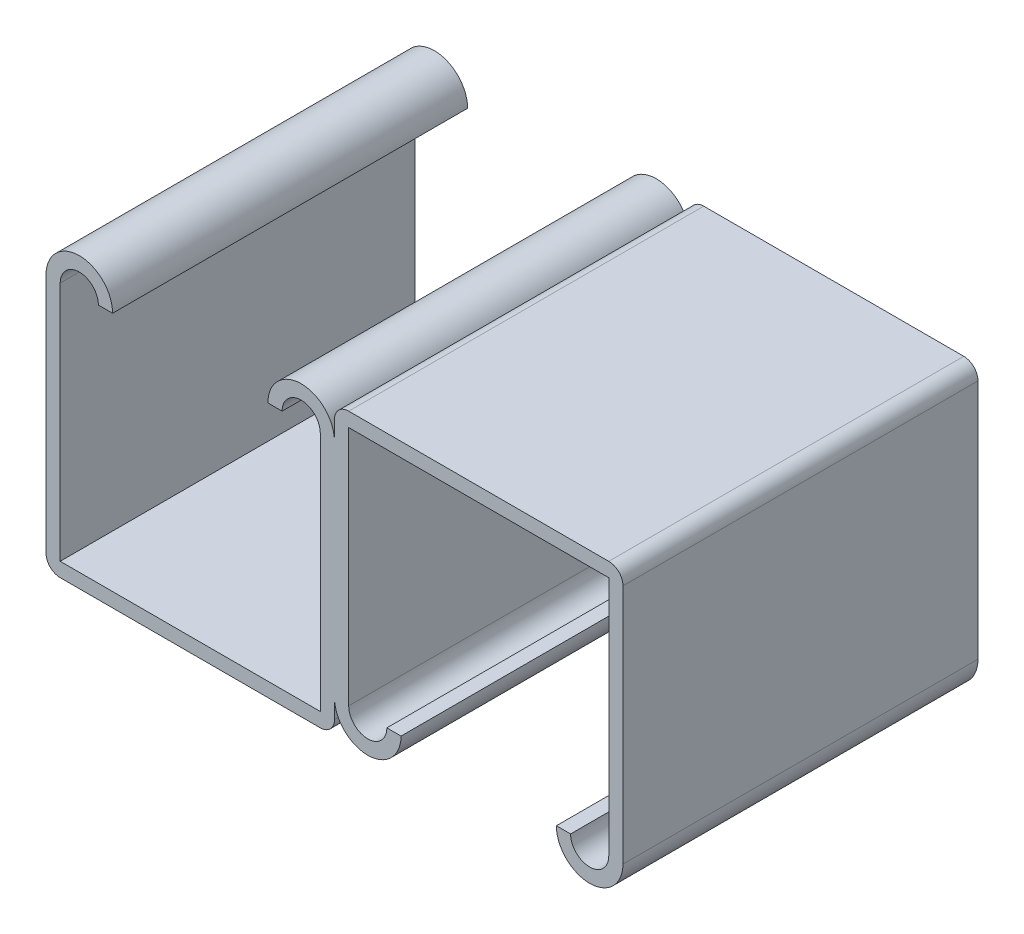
from build123d import *

# Parameters (mm, degrees)
BASE_EXTRUDE_DEPTH = 12.7
CIRPATTERN1_COUNT  = 2


with BuildPart() as part:
    # Sketch1 → Base-Extrude (new, symmetric)
    with BuildSketch(Plane.XY):
        with BuildLine():
            Line((-20.6375, 7.9375), (-20.6375, -9.30275))
            ThreePointArc((-20.6375, -9.30275), (-20.33992049, -10.02117049), (-19.6215, -10.31875))
            Line((-19.6215, -10.31875), (-1.016, -10.31875))
            ThreePointArc((-1.016, -10.31875), (-0.29757951, -10.02117049), (0, -9.30275))
            Line((0, -9.30275), (0, 7.9375))
            ThreePointArc((0, 7.9375), (-2.38125, 10.31875), (-4.7625, 7.9375))
            Line((-4.7625, 7.9375), (-3.7465, 7.9375))
            ThreePointArc((-3.7465, 7.9375), (-2.38125, 9.30275), (-1.016, 7.9375))
            Line((-1.016, 7.9375), (-1.016, -9.30275))
            Line((-1.016, -9.30275), (-19.6215, -9.30275))
            Line((-19.6215, -9.30275), (-19.6215, 7.9375))
            ThreePointArc((-19.6215, 7.9375), (-18.25625, 9.30275), (-16.891, 7.9375))
            Line((-16.891, 7.9375), (-15.875, 7.9375))
            ThreePointArc((-15.875, 7.9375), (-18.25625, 10.31875), (-20.6375, 7.9375))
        make_face()
    base_extrude = extrude(amount=BASE_EXTRUDE_DEPTH, both=True)

    # CirPattern1: Base-Extrude ×2 about axis
    cirpattern1_axis = Axis((0, 0, 0), (0, 0, 1))
    for i in range(1, CIRPATTERN1_COUNT):
        add(base_extrude.rotate(cirpattern1_axis, i * 360 / CIRPATTERN1_COUNT))


solid = part.part
